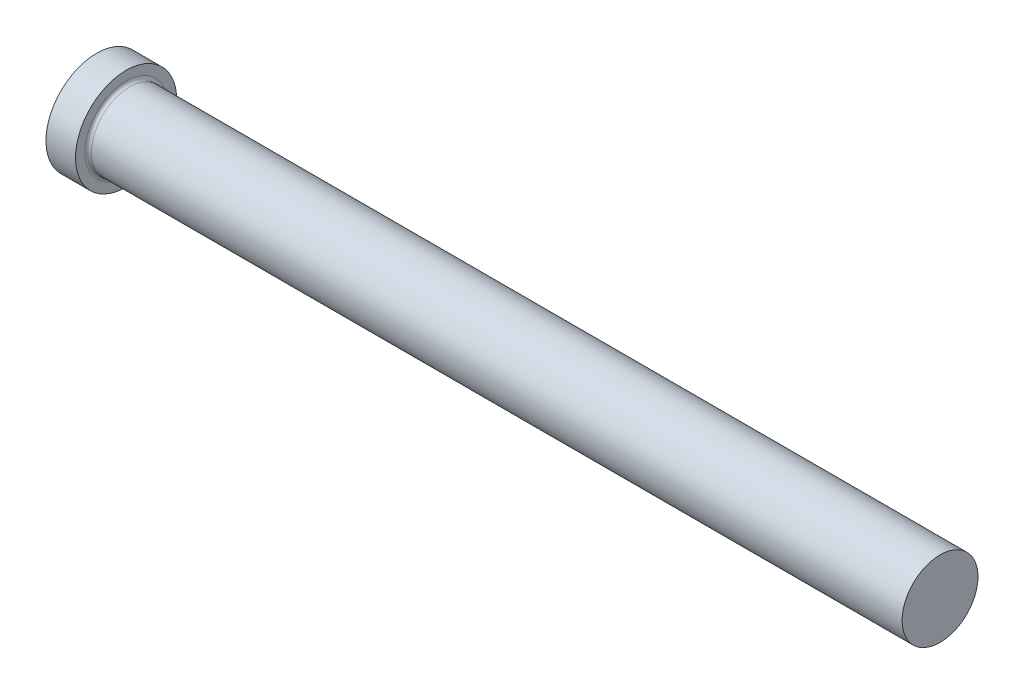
ISO-10303-21;
HEADER;
FILE_DESCRIPTION(('STEP AP214'),'2;1');
FILE_NAME('part.step','',(''),(''),'','','');
FILE_SCHEMA(('AUTOMOTIVE_DESIGN { 1 0 10303 214 1 1 1 1 }'));
ENDSEC;
DATA;
#1=APPLICATION_CONTEXT('core data for automotive mechanical design processes');
#2=APPLICATION_PROTOCOL_DEFINITION('international standard','automotive_design',2000,#1);
#3=PRODUCT_CONTEXT('',#1,'mechanical');
#4=PRODUCT('Part','Part','',(#3));
#5=PRODUCT_RELATED_PRODUCT_CATEGORY('part','',(#4));
#6=PRODUCT_DEFINITION_FORMATION('','',#4);
#7=PRODUCT_DEFINITION_CONTEXT('part definition',#1,'design');
#8=PRODUCT_DEFINITION('design','',#6,#7);
#9=PRODUCT_DEFINITION_SHAPE('','',#8);
#10=(LENGTH_UNIT() NAMED_UNIT(*) SI_UNIT(.MILLI.,.METRE.));
#11=(NAMED_UNIT(*) PLANE_ANGLE_UNIT() SI_UNIT($,.RADIAN.));
#12=(NAMED_UNIT(*) SI_UNIT($,.STERADIAN.) SOLID_ANGLE_UNIT());
#13=UNCERTAINTY_MEASURE_WITH_UNIT(LENGTH_MEASURE(1.E-05),#10,'distance_accuracy_value','');
#14=(GEOMETRIC_REPRESENTATION_CONTEXT(3) GLOBAL_UNCERTAINTY_ASSIGNED_CONTEXT((#13)) GLOBAL_UNIT_ASSIGNED_CONTEXT((#10,
#11,#12)) REPRESENTATION_CONTEXT('',''));
#15=CARTESIAN_POINT('',(0.,0.,0.));
#16=DIRECTION('',(0.,0.,1.));
#17=DIRECTION('',(1.,0.,0.));
#18=AXIS2_PLACEMENT_3D('',#15,#16,#17);
#19=CARTESIAN_POINT('',(0.,0.,0.));
#20=DIRECTION('',(-1.,0.,0.));
#21=DIRECTION('',(0.,-1.,0.));
#22=AXIS2_PLACEMENT_3D('',#19,#20,#21);
#23=PLANE('',#22);
#24=CARTESIAN_POINT('',(0.,0.,0.));
#25=DIRECTION('',(1.,0.,0.));
#26=DIRECTION('',(0.,1.,0.));
#27=AXIS2_PLACEMENT_3D('',#24,#25,#26);
#28=CIRCLE('',#27,12.);
#29=CARTESIAN_POINT('',(0.,12.,0.));
#30=VERTEX_POINT('',#29);
#31=EDGE_CURVE('E25',#30,#30,#28,.T.);
#32=ORIENTED_EDGE('',*,*,#31,.F.);
#33=EDGE_LOOP('',(#32));
#34=FACE_BOUND('',#33,.T.);
#35=ADVANCED_FACE('F14',(#34),#23,.T.);
#36=CARTESIAN_POINT('',(200.,0.,0.));
#37=DIRECTION('',(1.,0.,0.));
#38=DIRECTION('',(0.,1.,0.));
#39=AXIS2_PLACEMENT_3D('',#36,#37,#38);
#40=CYLINDRICAL_SURFACE('',#39,12.);
#41=ORIENTED_EDGE('',*,*,#31,.T.);
#42=EDGE_LOOP('',(#41));
#43=FACE_BOUND('',#42,.T.);
#44=CARTESIAN_POINT('',(7.,0.,0.));
#45=DIRECTION('',(1.,0.,0.));
#46=DIRECTION('',(0.,1.,0.));
#47=AXIS2_PLACEMENT_3D('',#44,#45,#46);
#48=CIRCLE('',#47,12.);
#49=CARTESIAN_POINT('',(7.,12.,0.));
#50=VERTEX_POINT('',#49);
#51=EDGE_CURVE('E29',#50,#50,#48,.T.);
#52=ORIENTED_EDGE('',*,*,#51,.F.);
#53=EDGE_LOOP('',(#52));
#54=FACE_BOUND('',#53,.T.);
#55=ADVANCED_FACE('F51',(#43,#54),#40,.T.);
#56=CARTESIAN_POINT('',(7.,12.,0.));
#57=DIRECTION('',(1.,0.,0.));
#58=DIRECTION('',(0.,1.,0.));
#59=AXIS2_PLACEMENT_3D('',#56,#57,#58);
#60=PLANE('',#59);
#61=CARTESIAN_POINT('',(7.,0.,0.));
#62=DIRECTION('',(1.,0.,0.));
#63=DIRECTION('',(0.,1.,0.));
#64=AXIS2_PLACEMENT_3D('',#61,#62,#63);
#65=CIRCLE('',#64,9.8);
#66=CARTESIAN_POINT('',(7.,9.8,0.));
#67=VERTEX_POINT('',#66);
#68=EDGE_CURVE('E9',#67,#67,#65,.F.);
#69=ORIENTED_EDGE('',*,*,#68,.T.);
#70=EDGE_LOOP('',(#69));
#71=FACE_BOUND('',#70,.T.);
#72=ORIENTED_EDGE('',*,*,#51,.T.);
#73=EDGE_LOOP('',(#72));
#74=FACE_BOUND('',#73,.T.);
#75=ADVANCED_FACE('F42',(#71,#74),#60,.T.);
#76=CARTESIAN_POINT('',(200.,0.,0.));
#77=DIRECTION('',(1.,0.,0.));
#78=DIRECTION('',(0.,1.,0.));
#79=AXIS2_PLACEMENT_3D('',#76,#77,#78);
#80=CYLINDRICAL_SURFACE('',#79,9.);
#81=CARTESIAN_POINT('',(7.8,0.,0.));
#82=DIRECTION('',(1.,0.,0.));
#83=DIRECTION('',(0.,1.,0.));
#84=AXIS2_PLACEMENT_3D('',#81,#82,#83);
#85=CIRCLE('',#84,9.);
#86=CARTESIAN_POINT('',(7.8,9.,0.));
#87=VERTEX_POINT('',#86);
#88=EDGE_CURVE('E21',#87,#87,#85,.T.);
#89=ORIENTED_EDGE('',*,*,#88,.T.);
#90=EDGE_LOOP('',(#89));
#91=FACE_BOUND('',#90,.T.);
#92=CARTESIAN_POINT('',(200.,0.,0.));
#93=DIRECTION('',(1.,0.,0.));
#94=DIRECTION('',(0.,1.,0.));
#95=AXIS2_PLACEMENT_3D('',#92,#93,#94);
#96=CIRCLE('',#95,9.);
#97=CARTESIAN_POINT('',(200.,9.00000000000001,0.));
#98=VERTEX_POINT('',#97);
#99=EDGE_CURVE('E34',#98,#98,#96,.T.);
#100=ORIENTED_EDGE('',*,*,#99,.F.);
#101=EDGE_LOOP('',(#100));
#102=FACE_BOUND('',#101,.T.);
#103=ADVANCED_FACE('F40',(#91,#102),#80,.T.);
#104=CARTESIAN_POINT('',(200.,9.,0.));
#105=DIRECTION('',(1.,0.,0.));
#106=DIRECTION('',(0.,1.,0.));
#107=AXIS2_PLACEMENT_3D('',#104,#105,#106);
#108=PLANE('',#107);
#109=ORIENTED_EDGE('',*,*,#99,.T.);
#110=EDGE_LOOP('',(#109));
#111=FACE_BOUND('',#110,.T.);
#112=ADVANCED_FACE('F38',(#111),#108,.T.);
#113=CARTESIAN_POINT('',(7.8,0.,0.));
#114=DIRECTION('',(1.,0.,0.));
#115=DIRECTION('',(0.,1.,0.));
#116=AXIS2_PLACEMENT_3D('',#113,#114,#115);
#117=TOROIDAL_SURFACE('',#116,9.8,0.8);
#118=ORIENTED_EDGE('',*,*,#68,.F.);
#119=EDGE_LOOP('',(#118));
#120=FACE_BOUND('',#119,.T.);
#121=ORIENTED_EDGE('',*,*,#88,.F.);
#122=EDGE_LOOP('',(#121));
#123=FACE_BOUND('',#122,.T.);
#124=ADVANCED_FACE('F16',(#120,#123),#117,.F.);
#125=CLOSED_SHELL('',(#35,#55,#75,#103,#112,#124));
#126=MANIFOLD_SOLID_BREP('B1',#125);
#127=ADVANCED_BREP_SHAPE_REPRESENTATION('',(#18,#126),#14);
#128=SHAPE_DEFINITION_REPRESENTATION(#9,#127);
ENDSEC;
END-ISO-10303-21;
